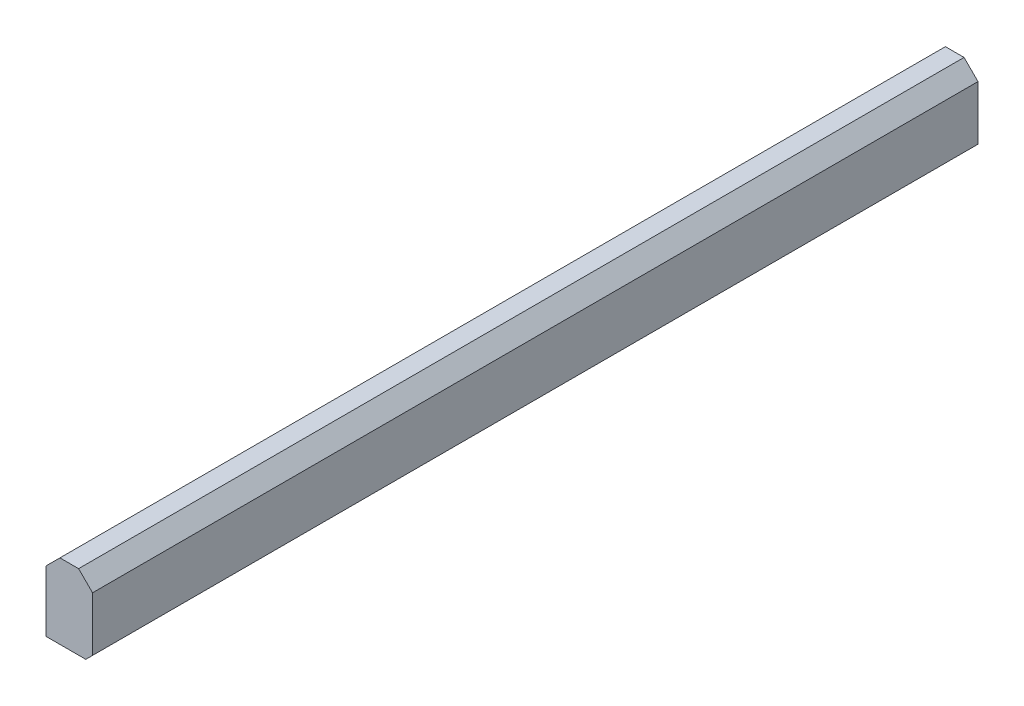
from build123d import *

# Parameters (mm, degrees)
SKETCH2_W           = 188.214
SKETCH2_H           = 116.84
BOSS_EXTRUDE1_DEPTH = 1111.357
CHAMFER1_SIZE       = 17
CHAMFER2_SIZE       = 35


with BuildPart() as part:
    # Sketch2 → Boss-Extrude1 (new, symmetric)
    with BuildSketch(Plane(origin=(0, 0, 0), x_dir=(0, 1, 0), z_dir=(0, 0, 1))):
        Rectangle(SKETCH2_W, SKETCH2_H)
    extrude(amount=BOSS_EXTRUDE1_DEPTH, both=True)

    # Chamfer1
    chamfer1_edges = [part.edges().sort_by_distance(p)[0] for p in [
        (58.42, -94.107, 0),
    ]]
    chamfer(chamfer1_edges, length=CHAMFER1_SIZE)

    # Chamfer2
    chamfer2_edges = [part.edges().sort_by_distance(p)[0] for p in [
        (58.42, 94.107, 0),
        (-58.42, 94.107, 0),
    ]]
    chamfer(chamfer2_edges, length=CHAMFER2_SIZE)


solid = part.part
